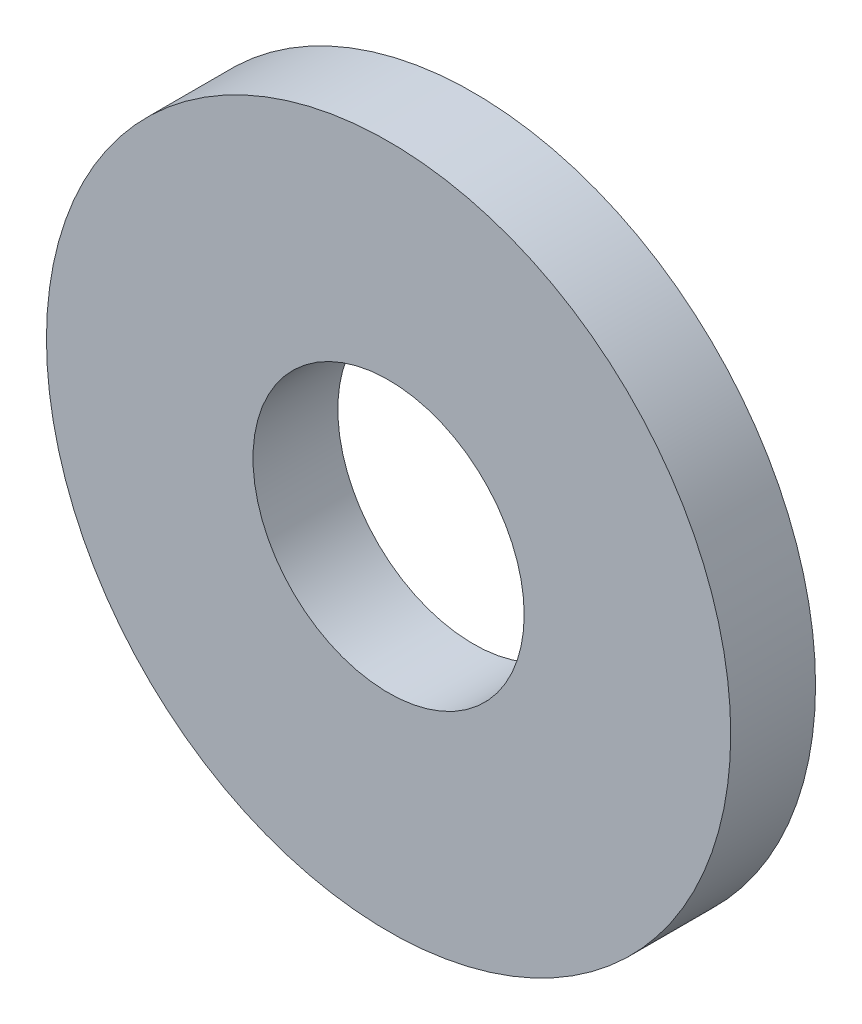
from build123d import *

# Parameters (mm, degrees)
ESQUISSE1_R        = 8.06772893
ESQUISSE1_R_2      = 3.19730266
BOSS_EXTRU_1_DEPTH = 2


with BuildPart() as part:
    # Esquisse1 → Boss.-Extru.1 (new body)
    with BuildSketch(Plane.XY):
        with Locations((38.379614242, 299.393845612)):
            Circle(ESQUISSE1_R)
        with Locations((38.379614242, 299.393845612)):
            Circle(ESQUISSE1_R_2, mode=Mode.SUBTRACT)
    extrude(amount=BOSS_EXTRU_1_DEPTH)


solid = part.part
